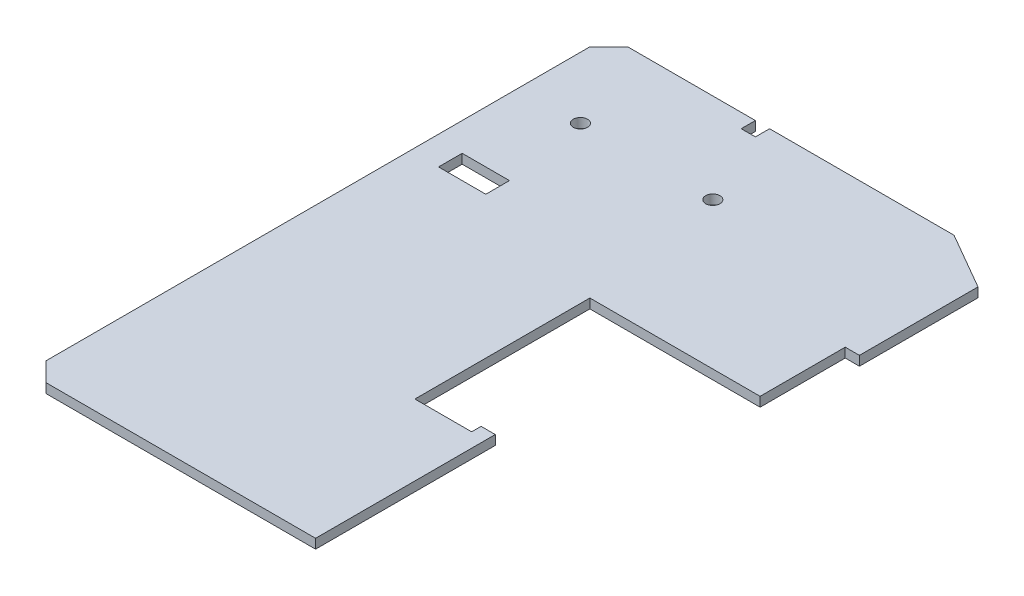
from build123d import *

# Parameters (mm, degrees)
ESQUISSE1_R      = 0.75
ESQUISSE1_W      = 5
ESQUISSE1_H      = 2.5
EXTRUSION1_DEPTH = 1


with BuildPart() as part:
    # Esquisse1 → Extrusion1 (new body)
    with BuildSketch(Plane(origin=(0, 0, 0), x_dir=(1, 0, 0), z_dir=(0, 1, 0))):
        Polygon((-23, -16), (-23, 41.5), (-21, 43.5), (-7.5, 43.5), (-7.5, 42), (-6, 42), (-6, 43.5), (13.5, 43.5), (19.5, 40.035898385), (19.5, 27.5), (18, 27.5), (18, 18.5), (0, 18.5), (0, 0), (6, 0), (6, 1), (7.5, 1), (7.5, -18), (-21, -18), align=None)
        with Locations(Location((-16.5, 34, 0), (0, 0, 270))):
            Circle(ESQUISSE1_R, mode=Mode.SUBTRACT)
        with Locations(Location((-2.5, 34, 0), (0, 0, 270))):
            Circle(ESQUISSE1_R, mode=Mode.SUBTRACT)
        with Locations((-17.5, 23.75)):
            Rectangle(ESQUISSE1_W, ESQUISSE1_H, mode=Mode.SUBTRACT)
    extrude(amount=EXTRUSION1_DEPTH)


solid = part.part
